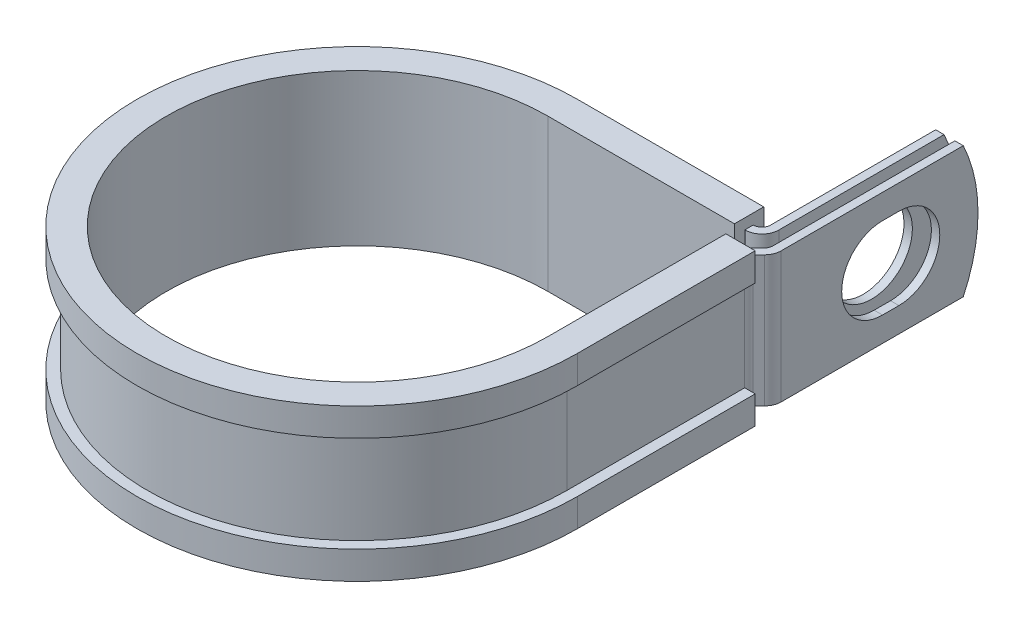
ISO-10303-21;
HEADER;
FILE_DESCRIPTION(('STEP AP214'),'2;1');
FILE_NAME('part.step','',(''),(''),'','','');
FILE_SCHEMA(('AUTOMOTIVE_DESIGN { 1 0 10303 214 1 1 1 1 }'));
ENDSEC;
DATA;
#1=APPLICATION_CONTEXT('core data for automotive mechanical design processes');
#2=APPLICATION_PROTOCOL_DEFINITION('international standard','automotive_design',2000,#1);
#3=PRODUCT_CONTEXT('',#1,'mechanical');
#4=PRODUCT('Part','Part','',(#3));
#5=PRODUCT_RELATED_PRODUCT_CATEGORY('part','',(#4));
#6=PRODUCT_DEFINITION_FORMATION('','',#4);
#7=PRODUCT_DEFINITION_CONTEXT('part definition',#1,'design');
#8=PRODUCT_DEFINITION('design','',#6,#7);
#9=PRODUCT_DEFINITION_SHAPE('','',#8);
#10=(LENGTH_UNIT() NAMED_UNIT(*) SI_UNIT(.MILLI.,.METRE.));
#11=(NAMED_UNIT(*) PLANE_ANGLE_UNIT() SI_UNIT($,.RADIAN.));
#12=(NAMED_UNIT(*) SI_UNIT($,.STERADIAN.) SOLID_ANGLE_UNIT());
#13=UNCERTAINTY_MEASURE_WITH_UNIT(LENGTH_MEASURE(1.E-05),#10,'distance_accuracy_value','');
#14=(GEOMETRIC_REPRESENTATION_CONTEXT(3) GLOBAL_UNCERTAINTY_ASSIGNED_CONTEXT((#13)) GLOBAL_UNIT_ASSIGNED_CONTEXT((#10,
#11,#12)) REPRESENTATION_CONTEXT('',''));
#15=CARTESIAN_POINT('',(0.,0.,0.));
#16=DIRECTION('',(0.,0.,1.));
#17=DIRECTION('',(1.,0.,0.));
#18=AXIS2_PLACEMENT_3D('',#15,#16,#17);
#19=CARTESIAN_POINT('',(29.9771698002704,-9.525,-29.2989));
#20=DIRECTION('',(0.,1.,0.));
#21=DIRECTION('',(1.,0.,0.));
#22=AXIS2_PLACEMENT_3D('',#19,#20,#21);
#23=PLANE('',#22);
#24=DIRECTION('',(0.,0.,-1.));
#25=VECTOR('',#24,1.);
#26=CARTESIAN_POINT('',(27.1323698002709,-9.525,-29.2989));
#27=LINE('',#26,#25);
#28=CARTESIAN_POINT('',(27.1323698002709,-9.525,-29.2989));
#29=VERTEX_POINT('',#28);
#30=CARTESIAN_POINT('',(27.1323698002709,-9.525,-30.5181));
#31=VERTEX_POINT('',#30);
#32=EDGE_CURVE('E524',#29,#31,#27,.T.);
#33=ORIENTED_EDGE('',*,*,#32,.T.);
#34=DIRECTION('',(-1.,0.,0.));
#35=VECTOR('',#34,1.);
#36=CARTESIAN_POINT('',(0.,-9.525,-30.5181));
#37=LINE('',#36,#35);
#38=CARTESIAN_POINT('',(27.1831698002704,-9.525,-30.5181));
#39=VERTEX_POINT('',#38);
#40=EDGE_CURVE('E411',#39,#31,#37,.T.);
#41=ORIENTED_EDGE('',*,*,#40,.F.);
#42=CARTESIAN_POINT('',(27.1831698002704,-9.525,-31.7373));
#43=DIRECTION('',(0.,1.,0.));
#44=DIRECTION('',(1.,0.,0.));
#45=AXIS2_PLACEMENT_3D('',#42,#43,#44);
#46=CIRCLE('',#45,1.2192);
#47=CARTESIAN_POINT('',(28.4023698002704,-9.525,-31.7373));
#48=VERTEX_POINT('',#47);
#49=EDGE_CURVE('E409',#48,#39,#46,.F.);
#50=ORIENTED_EDGE('',*,*,#49,.F.);
#51=DIRECTION('',(0.,0.,1.));
#52=VECTOR('',#51,1.);
#53=CARTESIAN_POINT('',(28.4023698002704,-9.525,-57.9374));
#54=LINE('',#53,#52);
#55=CARTESIAN_POINT('',(28.4023698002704,-9.525,-55.7928631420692));
#56=VERTEX_POINT('',#55);
#57=EDGE_CURVE('E407',#56,#48,#54,.T.);
#58=ORIENTED_EDGE('',*,*,#57,.F.);
#59=DIRECTION('',(-1.,0.,0.));
#60=VECTOR('',#59,1.);
#61=CARTESIAN_POINT('',(32.4155698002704,-9.525,-55.7928631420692));
#62=LINE('',#61,#60);
#63=CARTESIAN_POINT('',(29.6215698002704,-9.525,-55.7928631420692));
#64=VERTEX_POINT('',#63);
#65=EDGE_CURVE('E12',#64,#56,#62,.T.);
#66=ORIENTED_EDGE('',*,*,#65,.F.);
#67=DIRECTION('',(0.,0.,1.));
#68=VECTOR('',#67,1.);
#69=CARTESIAN_POINT('',(29.6215698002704,-9.525,-57.9374));
#70=LINE('',#69,#68);
#71=CARTESIAN_POINT('',(29.6215698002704,-9.525,-31.7373));
#72=VERTEX_POINT('',#71);
#73=EDGE_CURVE('E405',#64,#72,#70,.T.);
#74=ORIENTED_EDGE('',*,*,#73,.T.);
#75=CARTESIAN_POINT('',(27.1831698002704,-9.525,-31.7373));
#76=DIRECTION('',(0.,-1.,0.));
#77=DIRECTION('',(0.,0.,1.));
#78=AXIS2_PLACEMENT_3D('',#75,#76,#77);
#79=CIRCLE('',#78,2.4384);
#80=CARTESIAN_POINT('',(27.1831698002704,-9.525,-29.2989));
#81=VERTEX_POINT('',#80);
#82=EDGE_CURVE('E402',#72,#81,#79,.T.);
#83=ORIENTED_EDGE('',*,*,#82,.T.);
#84=DIRECTION('',(-1.,0.,0.));
#85=VECTOR('',#84,1.);
#86=CARTESIAN_POINT('',(0.,-9.525,-29.2989));
#87=LINE('',#86,#85);
#88=EDGE_CURVE('E399',#81,#29,#87,.T.);
#89=ORIENTED_EDGE('',*,*,#88,.T.);
#90=EDGE_LOOP('',(#33,#41,#50,#58,#66,#74,#83,#89));
#91=FACE_BOUND('',#90,.T.);
#92=ADVANCED_FACE('F55',(#91),#23,.F.);
#93=CARTESIAN_POINT('',(29.9771698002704,9.525,-29.2989));
#94=DIRECTION('',(0.,1.,0.));
#95=DIRECTION('',(1.,0.,0.));
#96=AXIS2_PLACEMENT_3D('',#93,#94,#95);
#97=PLANE('',#96);
#98=DIRECTION('',(-1.,0.,0.));
#99=VECTOR('',#98,1.);
#100=CARTESIAN_POINT('',(0.,9.525,-30.5181));
#101=LINE('',#100,#99);
#102=CARTESIAN_POINT('',(27.1831698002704,9.525,-30.5181));
#103=VERTEX_POINT('',#102);
#104=CARTESIAN_POINT('',(27.1323698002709,9.525,-30.5181));
#105=VERTEX_POINT('',#104);
#106=EDGE_CURVE('E369',#103,#105,#101,.T.);
#107=ORIENTED_EDGE('',*,*,#106,.T.);
#108=DIRECTION('',(0.,0.,1.));
#109=VECTOR('',#108,1.);
#110=CARTESIAN_POINT('',(27.1323698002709,9.525,-30.5181));
#111=LINE('',#110,#109);
#112=CARTESIAN_POINT('',(27.1323698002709,9.525,-29.2989));
#113=VERTEX_POINT('',#112);
#114=EDGE_CURVE('E518',#105,#113,#111,.T.);
#115=ORIENTED_EDGE('',*,*,#114,.T.);
#116=DIRECTION('',(-1.,0.,0.));
#117=VECTOR('',#116,1.);
#118=CARTESIAN_POINT('',(0.,9.525,-29.2989));
#119=LINE('',#118,#117);
#120=CARTESIAN_POINT('',(27.1831698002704,9.525,-29.2989));
#121=VERTEX_POINT('',#120);
#122=EDGE_CURVE('E626',#121,#113,#119,.T.);
#123=ORIENTED_EDGE('',*,*,#122,.F.);
#124=CARTESIAN_POINT('',(27.1831698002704,9.525,-31.7373));
#125=DIRECTION('',(0.,-1.,0.));
#126=DIRECTION('',(0.,0.,1.));
#127=AXIS2_PLACEMENT_3D('',#124,#125,#126);
#128=CIRCLE('',#127,2.4384);
#129=CARTESIAN_POINT('',(29.6215698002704,9.525,-31.7373));
#130=VERTEX_POINT('',#129);
#131=EDGE_CURVE('E371',#130,#121,#128,.T.);
#132=ORIENTED_EDGE('',*,*,#131,.F.);
#133=DIRECTION('',(0.,0.,1.));
#134=VECTOR('',#133,1.);
#135=CARTESIAN_POINT('',(29.6215698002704,9.525,-57.9374));
#136=LINE('',#135,#134);
#137=CARTESIAN_POINT('',(29.6215698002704,9.525,-55.7928631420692));
#138=VERTEX_POINT('',#137);
#139=EDGE_CURVE('E362',#138,#130,#136,.T.);
#140=ORIENTED_EDGE('',*,*,#139,.F.);
#141=DIRECTION('',(-1.,0.,0.));
#142=VECTOR('',#141,1.);
#143=CARTESIAN_POINT('',(32.4155698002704,9.525,-55.7928631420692));
#144=LINE('',#143,#142);
#145=CARTESIAN_POINT('',(28.4023698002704,9.525,-55.7928631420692));
#146=VERTEX_POINT('',#145);
#147=EDGE_CURVE('E63',#138,#146,#144,.T.);
#148=ORIENTED_EDGE('',*,*,#147,.T.);
#149=DIRECTION('',(0.,0.,1.));
#150=VECTOR('',#149,1.);
#151=CARTESIAN_POINT('',(28.4023698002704,9.525,-57.9374));
#152=LINE('',#151,#150);
#153=CARTESIAN_POINT('',(28.4023698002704,9.525,-31.7373));
#154=VERTEX_POINT('',#153);
#155=EDGE_CURVE('E359',#146,#154,#152,.T.);
#156=ORIENTED_EDGE('',*,*,#155,.T.);
#157=CARTESIAN_POINT('',(27.1831698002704,9.525,-31.7373));
#158=DIRECTION('',(0.,1.,0.));
#159=DIRECTION('',(1.,0.,0.));
#160=AXIS2_PLACEMENT_3D('',#157,#158,#159);
#161=CIRCLE('',#160,1.2192);
#162=EDGE_CURVE('E367',#154,#103,#161,.F.);
#163=ORIENTED_EDGE('',*,*,#162,.T.);
#164=EDGE_LOOP('',(#107,#115,#123,#132,#140,#148,#156,#163));
#165=FACE_BOUND('',#164,.T.);
#166=ADVANCED_FACE('F358',(#165),#97,.T.);
#167=CARTESIAN_POINT('',(0.,9.525,-29.2989));
#168=DIRECTION('',(0.,0.,1.));
#169=DIRECTION('',(1.,0.,0.));
#170=AXIS2_PLACEMENT_3D('',#167,#168,#169);
#171=PLANE('',#170);
#172=ORIENTED_EDGE('',*,*,#122,.T.);
#173=DIRECTION('',(0.,-1.,0.));
#174=VECTOR('',#173,1.);
#175=CARTESIAN_POINT('',(27.1323698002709,9.525,-29.2989));
#176=LINE('',#175,#174);
#177=EDGE_CURVE('E521',#113,#29,#176,.T.);
#178=ORIENTED_EDGE('',*,*,#177,.T.);
#179=ORIENTED_EDGE('',*,*,#88,.F.);
#180=DIRECTION('',(0.,-1.,0.));
#181=VECTOR('',#180,1.);
#182=CARTESIAN_POINT('',(27.1831698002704,9.525,-29.2989));
#183=LINE('',#182,#181);
#184=EDGE_CURVE('E345',#121,#81,#183,.T.);
#185=ORIENTED_EDGE('',*,*,#184,.F.);
#186=EDGE_LOOP('',(#172,#178,#179,#185));
#187=FACE_BOUND('',#186,.T.);
#188=ADVANCED_FACE('F636',(#187),#171,.T.);
#189=CARTESIAN_POINT('',(32.4155698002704,9.525,-29.2989));
#190=DIRECTION('',(-1.,0.,0.));
#191=DIRECTION('',(0.,0.,1.));
#192=AXIS2_PLACEMENT_3D('',#189,#190,#191);
#193=PLANE('',#192);
#194=CARTESIAN_POINT('',(32.4155698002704,0.,-46.4311999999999));
#195=DIRECTION('',(1.,0.,0.));
#196=DIRECTION('',(0.,0.,-1.));
#197=AXIS2_PLACEMENT_3D('',#194,#195,#196);
#198=CIRCLE('',#197,5.9436);
#199=CARTESIAN_POINT('',(32.4155698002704,-5.9436,-46.4312000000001));
#200=VERTEX_POINT('',#199);
#201=CARTESIAN_POINT('',(32.4155698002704,5.9436,-46.4312000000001));
#202=VERTEX_POINT('',#201);
#203=EDGE_CURVE('E581',#200,#202,#198,.T.);
#204=ORIENTED_EDGE('',*,*,#203,.F.);
#205=DIRECTION('',(0.,0.,-1.));
#206=VECTOR('',#205,1.);
#207=CARTESIAN_POINT('',(32.4155698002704,-5.9436,-44.0435999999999));
#208=LINE('',#207,#206);
#209=CARTESIAN_POINT('',(32.4155698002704,-5.9436,-44.0435999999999));
#210=VERTEX_POINT('',#209);
#211=EDGE_CURVE('E584',#210,#200,#208,.T.);
#212=ORIENTED_EDGE('',*,*,#211,.F.);
#213=CARTESIAN_POINT('',(32.4155698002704,0.,-44.0435999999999));
#214=DIRECTION('',(1.,0.,0.));
#215=DIRECTION('',(0.,0.,-1.));
#216=AXIS2_PLACEMENT_3D('',#213,#214,#215);
#217=CIRCLE('',#216,5.9436);
#218=CARTESIAN_POINT('',(32.4155698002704,5.9436,-44.0435999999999));
#219=VERTEX_POINT('',#218);
#220=EDGE_CURVE('E577',#219,#210,#217,.T.);
#221=ORIENTED_EDGE('',*,*,#220,.F.);
#222=DIRECTION('',(0.,0.,1.));
#223=VECTOR('',#222,1.);
#224=CARTESIAN_POINT('',(32.4155698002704,5.9436,-44.0435999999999));
#225=LINE('',#224,#223);
#226=EDGE_CURVE('E578',#202,#219,#225,.T.);
#227=ORIENTED_EDGE('',*,*,#226,.F.);
#228=EDGE_LOOP('',(#204,#212,#221,#227));
#229=FACE_BOUND('',#228,.T.);
#230=DIRECTION('',(0.,0.,-1.));
#231=VECTOR('',#230,1.);
#232=CARTESIAN_POINT('',(32.4155698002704,-9.525,-29.2989));
#233=LINE('',#232,#231);
#234=CARTESIAN_POINT('',(32.4155698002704,-9.525,-29.2989));
#235=VERTEX_POINT('',#234);
#236=CARTESIAN_POINT('',(32.4155698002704,-9.525,-55.7928631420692));
#237=VERTEX_POINT('',#236);
#238=EDGE_CURVE('E383',#235,#237,#233,.T.);
#239=ORIENTED_EDGE('',*,*,#238,.T.);
#240=CARTESIAN_POINT('',(32.4155698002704,0.,-35.7124));
#241=DIRECTION('',(-1.,0.,0.));
#242=DIRECTION('',(0.,0.,1.));
#243=AXIS2_PLACEMENT_3D('',#240,#241,#242);
#244=CIRCLE('',#243,22.225);
#245=CARTESIAN_POINT('',(32.4155698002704,9.525,-55.7928631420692));
#246=VERTEX_POINT('',#245);
#247=EDGE_CURVE('E569',#246,#237,#244,.T.);
#248=ORIENTED_EDGE('',*,*,#247,.F.);
#249=DIRECTION('',(0.,0.,-1.));
#250=VECTOR('',#249,1.);
#251=CARTESIAN_POINT('',(32.4155698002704,9.525,-29.2989));
#252=LINE('',#251,#250);
#253=CARTESIAN_POINT('',(32.4155698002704,9.525,-29.2989));
#254=VERTEX_POINT('',#253);
#255=EDGE_CURVE('E420',#254,#246,#252,.T.);
#256=ORIENTED_EDGE('',*,*,#255,.F.);
#257=DIRECTION('',(0.,-1.,0.));
#258=VECTOR('',#257,1.);
#259=CARTESIAN_POINT('',(32.4155698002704,9.525,-29.2989));
#260=LINE('',#259,#258);
#261=EDGE_CURVE('E382',#254,#235,#260,.T.);
#262=ORIENTED_EDGE('',*,*,#261,.T.);
#263=EDGE_LOOP('',(#239,#248,#256,#262));
#264=FACE_BOUND('',#263,.T.);
#265=ADVANCED_FACE('F57',(#229,#264),#193,.F.);
#266=CARTESIAN_POINT('',(31.1963698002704,9.525,-29.2989));
#267=DIRECTION('',(-1.,0.,0.));
#268=DIRECTION('',(0.,0.,1.));
#269=AXIS2_PLACEMENT_3D('',#266,#267,#268);
#270=PLANE('',#269);
#271=DIRECTION('',(0.,0.,-1.));
#272=VECTOR('',#271,1.);
#273=CARTESIAN_POINT('',(31.1963698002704,-5.9436,-44.0435999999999));
#274=LINE('',#273,#272);
#275=CARTESIAN_POINT('',(31.1963698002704,-5.9436,-44.0435999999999));
#276=VERTEX_POINT('',#275);
#277=CARTESIAN_POINT('',(31.1963698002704,-5.9436,-46.4312000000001));
#278=VERTEX_POINT('',#277);
#279=EDGE_CURVE('E580',#276,#278,#274,.T.);
#280=ORIENTED_EDGE('',*,*,#279,.T.);
#281=CARTESIAN_POINT('',(31.1963698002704,0.,-46.4311999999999));
#282=DIRECTION('',(-1.,0.,0.));
#283=DIRECTION('',(0.,0.,1.));
#284=AXIS2_PLACEMENT_3D('',#281,#282,#283);
#285=CIRCLE('',#284,5.9436);
#286=CARTESIAN_POINT('',(31.1963698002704,5.9436,-46.4312000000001));
#287=VERTEX_POINT('',#286);
#288=EDGE_CURVE('E601',#278,#287,#285,.F.);
#289=ORIENTED_EDGE('',*,*,#288,.T.);
#290=DIRECTION('',(0.,0.,1.));
#291=VECTOR('',#290,1.);
#292=CARTESIAN_POINT('',(31.1963698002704,5.9436,-44.0435999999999));
#293=LINE('',#292,#291);
#294=CARTESIAN_POINT('',(31.1963698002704,5.9436,-44.0435999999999));
#295=VERTEX_POINT('',#294);
#296=EDGE_CURVE('E597',#287,#295,#293,.T.);
#297=ORIENTED_EDGE('',*,*,#296,.T.);
#298=CARTESIAN_POINT('',(31.1963698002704,0.,-44.0435999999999));
#299=DIRECTION('',(-1.,0.,0.));
#300=DIRECTION('',(0.,0.,1.));
#301=AXIS2_PLACEMENT_3D('',#298,#299,#300);
#302=CIRCLE('',#301,5.9436);
#303=EDGE_CURVE('E592',#295,#276,#302,.F.);
#304=ORIENTED_EDGE('',*,*,#303,.T.);
#305=EDGE_LOOP('',(#280,#289,#297,#304));
#306=FACE_BOUND('',#305,.T.);
#307=CARTESIAN_POINT('',(31.1963698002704,0.,-35.7124));
#308=DIRECTION('',(-1.,0.,0.));
#309=DIRECTION('',(0.,0.,1.));
#310=AXIS2_PLACEMENT_3D('',#307,#308,#309);
#311=CIRCLE('',#310,22.225);
#312=CARTESIAN_POINT('',(31.1963698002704,9.525,-55.7928631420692));
#313=VERTEX_POINT('',#312);
#314=CARTESIAN_POINT('',(31.1963698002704,-9.525,-55.7928631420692));
#315=VERTEX_POINT('',#314);
#316=EDGE_CURVE('E77',#313,#315,#311,.T.);
#317=ORIENTED_EDGE('',*,*,#316,.T.);
#318=DIRECTION('',(0.,0.,-1.));
#319=VECTOR('',#318,1.);
#320=CARTESIAN_POINT('',(31.1963698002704,-9.525,-29.2989));
#321=LINE('',#320,#319);
#322=CARTESIAN_POINT('',(31.1963698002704,-9.525,-29.2989));
#323=VERTEX_POINT('',#322);
#324=EDGE_CURVE('E386',#323,#315,#321,.T.);
#325=ORIENTED_EDGE('',*,*,#324,.F.);
#326=DIRECTION('',(0.,-1.,0.));
#327=VECTOR('',#326,1.);
#328=CARTESIAN_POINT('',(31.1963698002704,9.525,-29.2989));
#329=LINE('',#328,#327);
#330=CARTESIAN_POINT('',(31.1963698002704,9.525,-29.2989));
#331=VERTEX_POINT('',#330);
#332=EDGE_CURVE('E353',#331,#323,#329,.T.);
#333=ORIENTED_EDGE('',*,*,#332,.F.);
#334=DIRECTION('',(0.,0.,-1.));
#335=VECTOR('',#334,1.);
#336=CARTESIAN_POINT('',(31.1963698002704,9.525,-29.2989));
#337=LINE('',#336,#335);
#338=EDGE_CURVE('E616',#331,#313,#337,.T.);
#339=ORIENTED_EDGE('',*,*,#338,.T.);
#340=EDGE_LOOP('',(#317,#325,#333,#339));
#341=FACE_BOUND('',#340,.T.);
#342=ADVANCED_FACE('F690',(#306,#341),#270,.T.);
#343=CARTESIAN_POINT('',(29.6215698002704,9.525,-57.9374));
#344=DIRECTION('',(1.,0.,0.));
#345=DIRECTION('',(0.,0.,-1.));
#346=AXIS2_PLACEMENT_3D('',#343,#344,#345);
#347=PLANE('',#346);
#348=CARTESIAN_POINT('',(29.6215698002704,0.,-45.2374));
#349=DIRECTION('',(1.,0.,0.));
#350=DIRECTION('',(0.,0.,-1.));
#351=AXIS2_PLACEMENT_3D('',#348,#349,#350);
#352=CIRCLE('',#351,5.9436);
#353=CARTESIAN_POINT('',(29.6215698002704,0.,-51.181));
#354=VERTEX_POINT('',#353);
#355=EDGE_CURVE('E387',#354,#354,#352,.F.);
#356=ORIENTED_EDGE('',*,*,#355,.T.);
#357=EDGE_LOOP('',(#356));
#358=FACE_BOUND('',#357,.T.);
#359=ORIENTED_EDGE('',*,*,#73,.F.);
#360=CARTESIAN_POINT('',(29.6215698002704,0.,-35.7124));
#361=DIRECTION('',(1.,0.,0.));
#362=DIRECTION('',(0.,0.,-1.));
#363=AXIS2_PLACEMENT_3D('',#360,#361,#362);
#364=CIRCLE('',#363,22.225);
#365=EDGE_CURVE('E574',#64,#138,#364,.T.);
#366=ORIENTED_EDGE('',*,*,#365,.T.);
#367=ORIENTED_EDGE('',*,*,#139,.T.);
#368=DIRECTION('',(0.,-1.,0.));
#369=VECTOR('',#368,1.);
#370=CARTESIAN_POINT('',(29.6215698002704,9.525,-31.7373));
#371=LINE('',#370,#369);
#372=EDGE_CURVE('E342',#130,#72,#371,.T.);
#373=ORIENTED_EDGE('',*,*,#372,.T.);
#374=EDGE_LOOP('',(#359,#366,#367,#373));
#375=FACE_BOUND('',#374,.T.);
#376=ADVANCED_FACE('F642',(#358,#375),#347,.T.);
#377=CARTESIAN_POINT('',(28.4023698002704,9.525,-57.9374));
#378=DIRECTION('',(1.,0.,0.));
#379=DIRECTION('',(0.,0.,-1.));
#380=AXIS2_PLACEMENT_3D('',#377,#378,#379);
#381=PLANE('',#380);
#382=CARTESIAN_POINT('',(28.4023698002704,0.,-45.2374));
#383=DIRECTION('',(-1.,0.,0.));
#384=DIRECTION('',(0.,0.,1.));
#385=AXIS2_PLACEMENT_3D('',#382,#383,#384);
#386=CIRCLE('',#385,5.9436);
#387=CARTESIAN_POINT('',(28.4023698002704,0.,-39.2938));
#388=VERTEX_POINT('',#387);
#389=EDGE_CURVE('E609',#388,#388,#386,.T.);
#390=ORIENTED_EDGE('',*,*,#389,.F.);
#391=EDGE_LOOP('',(#390));
#392=FACE_BOUND('',#391,.T.);
#393=CARTESIAN_POINT('',(28.4023698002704,0.,-35.7124));
#394=DIRECTION('',(-1.,0.,0.));
#395=DIRECTION('',(0.,0.,1.));
#396=AXIS2_PLACEMENT_3D('',#393,#394,#395);
#397=CIRCLE('',#396,22.225);
#398=EDGE_CURVE('E69',#146,#56,#397,.T.);
#399=ORIENTED_EDGE('',*,*,#398,.T.);
#400=ORIENTED_EDGE('',*,*,#57,.T.);
#401=DIRECTION('',(0.,-1.,0.));
#402=VECTOR('',#401,1.);
#403=CARTESIAN_POINT('',(28.4023698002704,9.525,-31.7373));
#404=LINE('',#403,#402);
#405=EDGE_CURVE('E339',#154,#48,#404,.T.);
#406=ORIENTED_EDGE('',*,*,#405,.F.);
#407=ORIENTED_EDGE('',*,*,#155,.F.);
#408=EDGE_LOOP('',(#399,#400,#406,#407));
#409=FACE_BOUND('',#408,.T.);
#410=ADVANCED_FACE('F365',(#392,#409),#381,.F.);
#411=CARTESIAN_POINT('',(31.7373,-9.525,-25.8864026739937));
#412=DIRECTION('',(0.,1.,0.));
#413=DIRECTION('',(1.,0.,0.));
#414=AXIS2_PLACEMENT_3D('',#411,#412,#413);
#415=CIRCLE('',#414,1.2192);
#416=CARTESIAN_POINT('',(30.5181,-9.525,-25.8864026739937));
#417=VERTEX_POINT('',#416);
#418=CARTESIAN_POINT('',(30.8751954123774,-9.525,-26.7485072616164));
#419=VERTEX_POINT('',#418);
#420=EDGE_CURVE('E414',#417,#419,#415,.F.);
#421=ORIENTED_EDGE('',*,*,#420,.F.);
#422=DIRECTION('',(1.,0.,0.));
#423=VECTOR('',#422,1.);
#424=CARTESIAN_POINT('',(29.2989,-9.525,-25.8864026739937));
#425=LINE('',#424,#423);
#426=CARTESIAN_POINT('',(29.2989,-9.525,-25.8864026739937));
#427=VERTEX_POINT('',#426);
#428=EDGE_CURVE('E452',#427,#417,#425,.T.);
#429=ORIENTED_EDGE('',*,*,#428,.F.);
#430=CARTESIAN_POINT('',(31.7373,-9.525,-25.8864026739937));
#431=DIRECTION('',(0.,-1.,0.));
#432=DIRECTION('',(0.,0.,1.));
#433=AXIS2_PLACEMENT_3D('',#430,#431,#432);
#434=CIRCLE('',#433,2.4384);
#435=CARTESIAN_POINT('',(30.0130908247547,-9.525,-27.610611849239));
#436=VERTEX_POINT('',#435);
#437=EDGE_CURVE('E396',#427,#436,#434,.T.);
#438=ORIENTED_EDGE('',*,*,#437,.T.);
#439=DIRECTION('',(0.707106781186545,0.,-0.70710678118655));
#440=VECTOR('',#439,1.);
#441=CARTESIAN_POINT('',(30.0130908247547,-9.525,-27.610611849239));
#442=LINE('',#441,#440);
#443=CARTESIAN_POINT('',(30.8392743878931,-9.525,-28.4367954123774));
#444=VERTEX_POINT('',#443);
#445=EDGE_CURVE('E393',#436,#444,#442,.T.);
#446=ORIENTED_EDGE('',*,*,#445,.T.);
#447=CARTESIAN_POINT('',(29.9771698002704,-9.525,-29.2989));
#448=DIRECTION('',(0.,1.,0.));
#449=DIRECTION('',(0.,0.,1.));
#450=AXIS2_PLACEMENT_3D('',#447,#448,#449);
#451=CIRCLE('',#450,1.2192);
#452=EDGE_CURVE('E390',#444,#323,#451,.T.);
#453=ORIENTED_EDGE('',*,*,#452,.T.);
#454=ORIENTED_EDGE('',*,*,#324,.T.);
#455=DIRECTION('',(-1.,0.,0.));
#456=VECTOR('',#455,1.);
#457=CARTESIAN_POINT('',(32.4155698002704,-9.525,-55.7928631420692));
#458=LINE('',#457,#456);
#459=EDGE_CURVE('E567',#237,#315,#458,.T.);
#460=ORIENTED_EDGE('',*,*,#459,.F.);
#461=ORIENTED_EDGE('',*,*,#238,.F.);
#462=CARTESIAN_POINT('',(29.9771698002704,-9.525,-29.2989));
#463=DIRECTION('',(0.,1.,0.));
#464=DIRECTION('',(1.,0.,0.));
#465=AXIS2_PLACEMENT_3D('',#462,#463,#464);
#466=CIRCLE('',#465,2.4384);
#467=CARTESIAN_POINT('',(31.7013789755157,-9.525,-27.5746908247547));
#468=VERTEX_POINT('',#467);
#469=EDGE_CURVE('E418',#468,#235,#466,.T.);
#470=ORIENTED_EDGE('',*,*,#469,.F.);
#471=DIRECTION('',(0.707106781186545,0.,-0.70710678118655));
#472=VECTOR('',#471,1.);
#473=CARTESIAN_POINT('',(30.8751954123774,-9.525,-26.7485072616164));
#474=LINE('',#473,#472);
#475=EDGE_CURVE('E416',#419,#468,#474,.T.);
#476=ORIENTED_EDGE('',*,*,#475,.F.);
#477=EDGE_LOOP('',(#421,#429,#438,#446,#453,#454,#460,#461,#470,#476));
#478=FACE_BOUND('',#477,.T.);
#479=ADVANCED_FACE('F676',(#478),#23,.F.);
#480=DIRECTION('',(-1.,0.,0.));
#481=VECTOR('',#480,1.);
#482=CARTESIAN_POINT('',(30.5181,9.525,-25.8864026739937));
#483=LINE('',#482,#481);
#484=CARTESIAN_POINT('',(30.5181,9.525,-25.8864026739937));
#485=VERTEX_POINT('',#484);
#486=CARTESIAN_POINT('',(29.2989,9.525,-25.8864026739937));
#487=VERTEX_POINT('',#486);
#488=EDGE_CURVE('E441',#485,#487,#483,.T.);
#489=ORIENTED_EDGE('',*,*,#488,.F.);
#490=CARTESIAN_POINT('',(31.7373,9.525,-25.8864026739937));
#491=DIRECTION('',(0.,1.,0.));
#492=DIRECTION('',(1.,0.,0.));
#493=AXIS2_PLACEMENT_3D('',#490,#491,#492);
#494=CIRCLE('',#493,1.2192);
#495=CARTESIAN_POINT('',(30.8751954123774,9.525,-26.7485072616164));
#496=VERTEX_POINT('',#495);
#497=EDGE_CURVE('E376',#485,#496,#494,.F.);
#498=ORIENTED_EDGE('',*,*,#497,.T.);
#499=DIRECTION('',(0.707106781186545,0.,-0.70710678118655));
#500=VECTOR('',#499,1.);
#501=CARTESIAN_POINT('',(30.8751954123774,9.525,-26.7485072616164));
#502=LINE('',#501,#500);
#503=CARTESIAN_POINT('',(31.7013789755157,9.525,-27.5746908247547));
#504=VERTEX_POINT('',#503);
#505=EDGE_CURVE('E378',#496,#504,#502,.T.);
#506=ORIENTED_EDGE('',*,*,#505,.T.);
#507=CARTESIAN_POINT('',(29.9771698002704,9.525,-29.2989));
#508=DIRECTION('',(0.,1.,0.));
#509=DIRECTION('',(1.,0.,0.));
#510=AXIS2_PLACEMENT_3D('',#507,#508,#509);
#511=CIRCLE('',#510,2.4384);
#512=EDGE_CURVE('E380',#504,#254,#511,.T.);
#513=ORIENTED_EDGE('',*,*,#512,.T.);
#514=ORIENTED_EDGE('',*,*,#255,.T.);
#515=DIRECTION('',(-1.,0.,0.));
#516=VECTOR('',#515,1.);
#517=CARTESIAN_POINT('',(32.4155698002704,9.525,-55.7928631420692));
#518=LINE('',#517,#516);
#519=EDGE_CURVE('E571',#246,#313,#518,.T.);
#520=ORIENTED_EDGE('',*,*,#519,.T.);
#521=ORIENTED_EDGE('',*,*,#338,.F.);
#522=CARTESIAN_POINT('',(29.9771698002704,9.525,-29.2989));
#523=DIRECTION('',(0.,1.,0.));
#524=DIRECTION('',(0.,0.,1.));
#525=AXIS2_PLACEMENT_3D('',#522,#523,#524);
#526=CIRCLE('',#525,1.2192);
#527=CARTESIAN_POINT('',(30.8392743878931,9.525,-28.4367954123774));
#528=VERTEX_POINT('',#527);
#529=EDGE_CURVE('E619',#528,#331,#526,.T.);
#530=ORIENTED_EDGE('',*,*,#529,.F.);
#531=DIRECTION('',(0.707106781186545,0.,-0.70710678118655));
#532=VECTOR('',#531,1.);
#533=CARTESIAN_POINT('',(30.0130908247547,9.525,-27.610611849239));
#534=LINE('',#533,#532);
#535=CARTESIAN_POINT('',(30.0130908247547,9.525,-27.610611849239));
#536=VERTEX_POINT('',#535);
#537=EDGE_CURVE('E622',#536,#528,#534,.T.);
#538=ORIENTED_EDGE('',*,*,#537,.F.);
#539=CARTESIAN_POINT('',(31.7373,9.525,-25.8864026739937));
#540=DIRECTION('',(0.,-1.,0.));
#541=DIRECTION('',(0.,0.,1.));
#542=AXIS2_PLACEMENT_3D('',#539,#540,#541);
#543=CIRCLE('',#542,2.4384);
#544=EDGE_CURVE('E451',#487,#536,#543,.T.);
#545=ORIENTED_EDGE('',*,*,#544,.F.);
#546=EDGE_LOOP('',(#489,#498,#506,#513,#514,#520,#521,#530,#538,#545));
#547=FACE_BOUND('',#546,.T.);
#548=ADVANCED_FACE('F448',(#547),#97,.T.);
#549=CARTESIAN_POINT('',(29.9771698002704,9.525,-29.2989));
#550=DIRECTION('',(0.,-1.,0.));
#551=DIRECTION('',(0.,0.,-1.));
#552=AXIS2_PLACEMENT_3D('',#549,#550,#551);
#553=CYLINDRICAL_SURFACE('',#552,1.2192);
#554=ORIENTED_EDGE('',*,*,#452,.F.);
#555=DIRECTION('',(0.,-1.,0.));
#556=VECTOR('',#555,1.);
#557=CARTESIAN_POINT('',(30.8392743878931,9.525,-28.4367954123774));
#558=LINE('',#557,#556);
#559=EDGE_CURVE('E351',#528,#444,#558,.T.);
#560=ORIENTED_EDGE('',*,*,#559,.F.);
#561=ORIENTED_EDGE('',*,*,#529,.T.);
#562=ORIENTED_EDGE('',*,*,#332,.T.);
#563=EDGE_LOOP('',(#554,#560,#561,#562));
#564=FACE_BOUND('',#563,.T.);
#565=ADVANCED_FACE('F686',(#564),#553,.F.);
#566=CARTESIAN_POINT('',(30.0130908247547,9.525,-27.610611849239));
#567=DIRECTION('',(-0.70710678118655,0.,-0.707106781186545));
#568=DIRECTION('',(-0.707106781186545,0.,0.70710678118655));
#569=AXIS2_PLACEMENT_3D('',#566,#567,#568);
#570=PLANE('',#569);
#571=ORIENTED_EDGE('',*,*,#445,.F.);
#572=DIRECTION('',(0.,-1.,0.));
#573=VECTOR('',#572,1.);
#574=CARTESIAN_POINT('',(30.0130908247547,9.525,-27.610611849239));
#575=LINE('',#574,#573);
#576=EDGE_CURVE('E349',#536,#436,#575,.T.);
#577=ORIENTED_EDGE('',*,*,#576,.F.);
#578=ORIENTED_EDGE('',*,*,#537,.T.);
#579=ORIENTED_EDGE('',*,*,#559,.T.);
#580=EDGE_LOOP('',(#571,#577,#578,#579));
#581=FACE_BOUND('',#580,.T.);
#582=ADVANCED_FACE('F681',(#581),#570,.T.);
#583=CARTESIAN_POINT('',(31.7373,9.525,-25.8864026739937));
#584=DIRECTION('',(0.,-1.,0.));
#585=DIRECTION('',(0.,0.,-1.));
#586=AXIS2_PLACEMENT_3D('',#583,#584,#585);
#587=CYLINDRICAL_SURFACE('',#586,2.4384);
#588=ORIENTED_EDGE('',*,*,#437,.F.);
#589=DIRECTION('',(0.,-1.,0.));
#590=VECTOR('',#589,1.);
#591=CARTESIAN_POINT('',(29.2989,9.525,-25.8864026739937));
#592=LINE('',#591,#590);
#593=EDGE_CURVE('E347',#487,#427,#592,.T.);
#594=ORIENTED_EDGE('',*,*,#593,.F.);
#595=ORIENTED_EDGE('',*,*,#544,.T.);
#596=ORIENTED_EDGE('',*,*,#576,.T.);
#597=EDGE_LOOP('',(#588,#594,#595,#596));
#598=FACE_BOUND('',#597,.T.);
#599=ADVANCED_FACE('F678',(#598),#587,.T.);
#600=CARTESIAN_POINT('',(27.1831698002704,9.525,-31.7373));
#601=DIRECTION('',(0.,-1.,0.));
#602=DIRECTION('',(0.,0.,-1.));
#603=AXIS2_PLACEMENT_3D('',#600,#601,#602);
#604=CYLINDRICAL_SURFACE('',#603,2.4384);
#605=ORIENTED_EDGE('',*,*,#82,.F.);
#606=ORIENTED_EDGE('',*,*,#372,.F.);
#607=ORIENTED_EDGE('',*,*,#131,.T.);
#608=ORIENTED_EDGE('',*,*,#184,.T.);
#609=EDGE_LOOP('',(#605,#606,#607,#608));
#610=FACE_BOUND('',#609,.T.);
#611=ADVANCED_FACE('F632',(#610),#604,.T.);
#612=CARTESIAN_POINT('',(27.1831698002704,9.525,-31.7373));
#613=DIRECTION('',(0.,-1.,0.));
#614=DIRECTION('',(0.,0.,-1.));
#615=AXIS2_PLACEMENT_3D('',#612,#613,#614);
#616=CYLINDRICAL_SURFACE('',#615,1.2192);
#617=ORIENTED_EDGE('',*,*,#49,.T.);
#618=DIRECTION('',(0.,-1.,0.));
#619=VECTOR('',#618,1.);
#620=CARTESIAN_POINT('',(27.1831698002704,9.525,-30.5181));
#621=LINE('',#620,#619);
#622=EDGE_CURVE('E330',#103,#39,#621,.T.);
#623=ORIENTED_EDGE('',*,*,#622,.F.);
#624=ORIENTED_EDGE('',*,*,#162,.F.);
#625=ORIENTED_EDGE('',*,*,#405,.T.);
#626=EDGE_LOOP('',(#617,#623,#624,#625));
#627=FACE_BOUND('',#626,.T.);
#628=ADVANCED_FACE('F647',(#627),#616,.F.);
#629=CARTESIAN_POINT('',(0.,9.525,-30.5181));
#630=DIRECTION('',(0.,0.,1.));
#631=DIRECTION('',(1.,0.,0.));
#632=AXIS2_PLACEMENT_3D('',#629,#630,#631);
#633=PLANE('',#632);
#634=DIRECTION('',(0.,-1.,0.));
#635=VECTOR('',#634,1.);
#636=CARTESIAN_POINT('',(0.,9.525,-30.5181));
#637=LINE('',#636,#635);
#638=CARTESIAN_POINT('',(4.28082201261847E-13,6.985,-30.5181));
#639=VERTEX_POINT('',#638);
#640=CARTESIAN_POINT('',(4.28082201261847E-13,-6.985,-30.5181));
#641=VERTEX_POINT('',#640);
#642=EDGE_CURVE('E321',#639,#641,#637,.T.);
#643=ORIENTED_EDGE('',*,*,#642,.F.);
#644=DIRECTION('',(1.,0.,0.));
#645=VECTOR('',#644,1.);
#646=CARTESIAN_POINT('',(4.28082201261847E-13,6.985,-30.5181));
#647=LINE('',#646,#645);
#648=CARTESIAN_POINT('',(27.1323698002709,6.985,-30.5181));
#649=VERTEX_POINT('',#648);
#650=EDGE_CURVE('E564',#639,#649,#647,.T.);
#651=ORIENTED_EDGE('',*,*,#650,.T.);
#652=DIRECTION('',(0.,1.,0.));
#653=VECTOR('',#652,1.);
#654=CARTESIAN_POINT('',(27.1323698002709,9.525,-30.5181));
#655=LINE('',#654,#653);
#656=EDGE_CURVE('E515',#649,#105,#655,.T.);
#657=ORIENTED_EDGE('',*,*,#656,.T.);
#658=ORIENTED_EDGE('',*,*,#106,.F.);
#659=ORIENTED_EDGE('',*,*,#622,.T.);
#660=ORIENTED_EDGE('',*,*,#40,.T.);
#661=DIRECTION('',(0.,1.,0.));
#662=VECTOR('',#661,1.);
#663=CARTESIAN_POINT('',(27.1323698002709,-9.525,-30.5181));
#664=LINE('',#663,#662);
#665=CARTESIAN_POINT('',(27.1323698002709,-6.985,-30.5181));
#666=VERTEX_POINT('',#665);
#667=EDGE_CURVE('E527',#31,#666,#664,.T.);
#668=ORIENTED_EDGE('',*,*,#667,.T.);
#669=DIRECTION('',(1.,0.,0.));
#670=VECTOR('',#669,1.);
#671=CARTESIAN_POINT('',(4.28082201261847E-13,-6.985,-30.5181));
#672=LINE('',#671,#670);
#673=EDGE_CURVE('E544',#641,#666,#672,.T.);
#674=ORIENTED_EDGE('',*,*,#673,.F.);
#675=EDGE_LOOP('',(#643,#651,#657,#658,#659,#660,#668,#674));
#676=FACE_BOUND('',#675,.T.);
#677=ADVANCED_FACE('F651',(#676),#633,.F.);
#678=CARTESIAN_POINT('',(0.,9.525,0.));
#679=DIRECTION('',(0.,-1.,0.));
#680=DIRECTION('',(0.,0.,-1.));
#681=AXIS2_PLACEMENT_3D('',#678,#679,#680);
#682=CYLINDRICAL_SURFACE('',#681,30.5181);
#683=DIRECTION('',(0.,-1.,0.));
#684=VECTOR('',#683,1.);
#685=CARTESIAN_POINT('',(30.5181,9.525,0.));
#686=LINE('',#685,#684);
#687=CARTESIAN_POINT('',(30.5181,6.985,0.));
#688=VERTEX_POINT('',#687);
#689=CARTESIAN_POINT('',(30.5181,-6.985,0.));
#690=VERTEX_POINT('',#689);
#691=EDGE_CURVE('E319',#688,#690,#686,.T.);
#692=ORIENTED_EDGE('',*,*,#691,.F.);
#693=CARTESIAN_POINT('',(0.,6.985,0.));
#694=DIRECTION('',(0.,-1.,0.));
#695=DIRECTION('',(0.,0.,-1.));
#696=AXIS2_PLACEMENT_3D('',#693,#694,#695);
#697=CIRCLE('',#696,30.5181);
#698=EDGE_CURVE('E513',#688,#639,#697,.T.);
#699=ORIENTED_EDGE('',*,*,#698,.T.);
#700=ORIENTED_EDGE('',*,*,#642,.T.);
#701=CARTESIAN_POINT('',(0.,-6.985,0.));
#702=DIRECTION('',(0.,-1.,0.));
#703=DIRECTION('',(0.,0.,-1.));
#704=AXIS2_PLACEMENT_3D('',#701,#702,#703);
#705=CIRCLE('',#704,30.5181);
#706=EDGE_CURVE('E302',#690,#641,#705,.T.);
#707=ORIENTED_EDGE('',*,*,#706,.F.);
#708=EDGE_LOOP('',(#692,#699,#700,#707));
#709=FACE_BOUND('',#708,.T.);
#710=ADVANCED_FACE('F317',(#709),#682,.T.);
#711=CARTESIAN_POINT('',(30.5181,9.525,0.));
#712=DIRECTION('',(-1.,0.,0.));
#713=DIRECTION('',(0.,0.,1.));
#714=AXIS2_PLACEMENT_3D('',#711,#712,#713);
#715=PLANE('',#714);
#716=DIRECTION('',(0.,-1.,0.));
#717=VECTOR('',#716,1.);
#718=CARTESIAN_POINT('',(30.5181,9.525,-25.8864026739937));
#719=LINE('',#718,#717);
#720=CARTESIAN_POINT('',(30.5181,6.985,-25.8864026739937));
#721=VERTEX_POINT('',#720);
#722=CARTESIAN_POINT('',(30.5181,-6.985,-25.8864026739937));
#723=VERTEX_POINT('',#722);
#724=EDGE_CURVE('E333',#721,#723,#719,.T.);
#725=ORIENTED_EDGE('',*,*,#724,.F.);
#726=DIRECTION('',(0.,0.,-1.));
#727=VECTOR('',#726,1.);
#728=CARTESIAN_POINT('',(30.5181,6.985,0.));
#729=LINE('',#728,#727);
#730=EDGE_CURVE('E327',#688,#721,#729,.T.);
#731=ORIENTED_EDGE('',*,*,#730,.F.);
#732=ORIENTED_EDGE('',*,*,#691,.T.);
#733=DIRECTION('',(0.,0.,-1.));
#734=VECTOR('',#733,1.);
#735=CARTESIAN_POINT('',(30.5181,-6.985,0.));
#736=LINE('',#735,#734);
#737=EDGE_CURVE('E298',#690,#723,#736,.T.);
#738=ORIENTED_EDGE('',*,*,#737,.T.);
#739=EDGE_LOOP('',(#725,#731,#732,#738));
#740=FACE_BOUND('',#739,.T.);
#741=ADVANCED_FACE('F326',(#740),#715,.F.);
#742=CARTESIAN_POINT('',(31.7373,9.525,-25.8864026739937));
#743=DIRECTION('',(0.,-1.,0.));
#744=DIRECTION('',(0.,0.,-1.));
#745=AXIS2_PLACEMENT_3D('',#742,#743,#744);
#746=CYLINDRICAL_SURFACE('',#745,1.2192);
#747=ORIENTED_EDGE('',*,*,#420,.T.);
#748=DIRECTION('',(0.,-1.,0.));
#749=VECTOR('',#748,1.);
#750=CARTESIAN_POINT('',(30.8751954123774,9.525,-26.7485072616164));
#751=LINE('',#750,#749);
#752=EDGE_CURVE('E425',#496,#419,#751,.T.);
#753=ORIENTED_EDGE('',*,*,#752,.F.);
#754=ORIENTED_EDGE('',*,*,#497,.F.);
#755=EDGE_CURVE('E328',#485,#721,#719,.T.);
#756=ORIENTED_EDGE('',*,*,#755,.T.);
#757=ORIENTED_EDGE('',*,*,#724,.T.);
#758=DIRECTION('',(0.,1.,0.));
#759=VECTOR('',#758,1.);
#760=CARTESIAN_POINT('',(30.5181,-9.525,-25.8864026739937));
#761=LINE('',#760,#759);
#762=EDGE_CURVE('E434',#417,#723,#761,.T.);
#763=ORIENTED_EDGE('',*,*,#762,.F.);
#764=EDGE_LOOP('',(#747,#753,#754,#756,#757,#763));
#765=FACE_BOUND('',#764,.T.);
#766=ADVANCED_FACE('F433',(#765),#746,.F.);
#767=CARTESIAN_POINT('',(30.8751954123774,9.525,-26.7485072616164));
#768=DIRECTION('',(-0.70710678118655,0.,-0.707106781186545));
#769=DIRECTION('',(-0.707106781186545,0.,0.70710678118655));
#770=AXIS2_PLACEMENT_3D('',#767,#768,#769);
#771=PLANE('',#770);
#772=ORIENTED_EDGE('',*,*,#475,.T.);
#773=DIRECTION('',(0.,-1.,0.));
#774=VECTOR('',#773,1.);
#775=CARTESIAN_POINT('',(31.7013789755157,9.525,-27.5746908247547));
#776=LINE('',#775,#774);
#777=EDGE_CURVE('E423',#504,#468,#776,.T.);
#778=ORIENTED_EDGE('',*,*,#777,.F.);
#779=ORIENTED_EDGE('',*,*,#505,.F.);
#780=ORIENTED_EDGE('',*,*,#752,.T.);
#781=EDGE_LOOP('',(#772,#778,#779,#780));
#782=FACE_BOUND('',#781,.T.);
#783=ADVANCED_FACE('F702',(#782),#771,.F.);
#784=CARTESIAN_POINT('',(29.9771698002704,9.525,-29.2989));
#785=DIRECTION('',(0.,-1.,0.));
#786=DIRECTION('',(0.,0.,-1.));
#787=AXIS2_PLACEMENT_3D('',#784,#785,#786);
#788=CYLINDRICAL_SURFACE('',#787,2.4384);
#789=ORIENTED_EDGE('',*,*,#469,.T.);
#790=ORIENTED_EDGE('',*,*,#261,.F.);
#791=ORIENTED_EDGE('',*,*,#512,.F.);
#792=ORIENTED_EDGE('',*,*,#777,.T.);
#793=EDGE_LOOP('',(#789,#790,#791,#792));
#794=FACE_BOUND('',#793,.T.);
#795=ADVANCED_FACE('F700',(#794),#788,.T.);
#796=CARTESIAN_POINT('',(46.4326092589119,0.,-45.2374));
#797=DIRECTION('',(-1.,0.,0.));
#798=DIRECTION('',(0.,0.,1.));
#799=AXIS2_PLACEMENT_3D('',#796,#797,#798);
#800=CYLINDRICAL_SURFACE('',#799,5.9436);
#801=ORIENTED_EDGE('',*,*,#389,.T.);
#802=EDGE_LOOP('',(#801));
#803=FACE_BOUND('',#802,.T.);
#804=ORIENTED_EDGE('',*,*,#355,.F.);
#805=EDGE_LOOP('',(#804));
#806=FACE_BOUND('',#805,.T.);
#807=ADVANCED_FACE('F709',(#803,#806),#800,.F.);
#808=CARTESIAN_POINT('',(12.6201635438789,-5.9436,-44.0435999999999));
#809=DIRECTION('',(0.,-1.,0.));
#810=DIRECTION('',(0.,0.,-1.));
#811=AXIS2_PLACEMENT_3D('',#808,#809,#810);
#812=PLANE('',#811);
#813=DIRECTION('',(1.,0.,0.));
#814=VECTOR('',#813,1.);
#815=CARTESIAN_POINT('',(12.6201635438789,-5.9436,-44.0435999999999));
#816=LINE('',#815,#814);
#817=EDGE_CURVE('E595',#276,#210,#816,.T.);
#818=ORIENTED_EDGE('',*,*,#817,.T.);
#819=ORIENTED_EDGE('',*,*,#211,.T.);
#820=DIRECTION('',(1.,0.,0.));
#821=VECTOR('',#820,1.);
#822=CARTESIAN_POINT('',(12.6201635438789,-5.9436,-46.4312000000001));
#823=LINE('',#822,#821);
#824=EDGE_CURVE('E591',#278,#200,#823,.T.);
#825=ORIENTED_EDGE('',*,*,#824,.F.);
#826=ORIENTED_EDGE('',*,*,#279,.F.);
#827=EDGE_LOOP('',(#818,#819,#825,#826));
#828=FACE_BOUND('',#827,.T.);
#829=ADVANCED_FACE('F752',(#828),#812,.F.);
#830=CARTESIAN_POINT('',(12.6201635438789,0.,-46.4311999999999));
#831=DIRECTION('',(1.,0.,0.));
#832=DIRECTION('',(0.,0.,-1.));
#833=AXIS2_PLACEMENT_3D('',#830,#831,#832);
#834=CYLINDRICAL_SURFACE('',#833,5.9436);
#835=ORIENTED_EDGE('',*,*,#824,.T.);
#836=ORIENTED_EDGE('',*,*,#203,.T.);
#837=DIRECTION('',(1.,0.,0.));
#838=VECTOR('',#837,1.);
#839=CARTESIAN_POINT('',(12.6201635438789,5.9436,-46.4312000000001));
#840=LINE('',#839,#838);
#841=EDGE_CURVE('E600',#287,#202,#840,.T.);
#842=ORIENTED_EDGE('',*,*,#841,.F.);
#843=ORIENTED_EDGE('',*,*,#288,.F.);
#844=EDGE_LOOP('',(#835,#836,#842,#843));
#845=FACE_BOUND('',#844,.T.);
#846=ADVANCED_FACE('F756',(#845),#834,.F.);
#847=CARTESIAN_POINT('',(12.6201635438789,5.9436,-44.0435999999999));
#848=DIRECTION('',(0.,1.,0.));
#849=DIRECTION('',(0.,0.,1.));
#850=AXIS2_PLACEMENT_3D('',#847,#848,#849);
#851=PLANE('',#850);
#852=ORIENTED_EDGE('',*,*,#841,.T.);
#853=ORIENTED_EDGE('',*,*,#226,.T.);
#854=DIRECTION('',(1.,0.,0.));
#855=VECTOR('',#854,1.);
#856=CARTESIAN_POINT('',(12.6201635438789,5.9436,-44.0435999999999));
#857=LINE('',#856,#855);
#858=EDGE_CURVE('E596',#295,#219,#857,.T.);
#859=ORIENTED_EDGE('',*,*,#858,.F.);
#860=ORIENTED_EDGE('',*,*,#296,.F.);
#861=EDGE_LOOP('',(#852,#853,#859,#860));
#862=FACE_BOUND('',#861,.T.);
#863=ADVANCED_FACE('F760',(#862),#851,.F.);
#864=CARTESIAN_POINT('',(12.6201635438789,0.,-44.0435999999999));
#865=DIRECTION('',(1.,0.,0.));
#866=DIRECTION('',(0.,0.,-1.));
#867=AXIS2_PLACEMENT_3D('',#864,#865,#866);
#868=CYLINDRICAL_SURFACE('',#867,5.9436);
#869=ORIENTED_EDGE('',*,*,#858,.T.);
#870=ORIENTED_EDGE('',*,*,#220,.T.);
#871=ORIENTED_EDGE('',*,*,#817,.F.);
#872=ORIENTED_EDGE('',*,*,#303,.F.);
#873=EDGE_LOOP('',(#869,#870,#871,#872));
#874=FACE_BOUND('',#873,.T.);
#875=ADVANCED_FACE('F764',(#874),#868,.F.);
#876=CARTESIAN_POINT('',(32.4155698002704,0.,-35.7124));
#877=DIRECTION('',(-1.,0.,0.));
#878=DIRECTION('',(0.,0.,1.));
#879=AXIS2_PLACEMENT_3D('',#876,#877,#878);
#880=CYLINDRICAL_SURFACE('',#879,22.225);
#881=ORIENTED_EDGE('',*,*,#365,.F.);
#882=ORIENTED_EDGE('',*,*,#65,.T.);
#883=ORIENTED_EDGE('',*,*,#398,.F.);
#884=ORIENTED_EDGE('',*,*,#147,.F.);
#885=EDGE_LOOP('',(#881,#882,#883,#884));
#886=FACE_BOUND('',#885,.T.);
#887=ADVANCED_FACE('F643',(#886),#880,.T.);
#888=ORIENTED_EDGE('',*,*,#519,.F.);
#889=ORIENTED_EDGE('',*,*,#247,.T.);
#890=ORIENTED_EDGE('',*,*,#459,.T.);
#891=ORIENTED_EDGE('',*,*,#316,.F.);
#892=EDGE_LOOP('',(#888,#889,#890,#891));
#893=FACE_BOUND('',#892,.T.);
#894=ADVANCED_FACE('F691',(#893),#880,.T.);
#895=CARTESIAN_POINT('',(4.4945958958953E-13,11.049,-32.0421));
#896=DIRECTION('',(0.,0.,1.));
#897=DIRECTION('',(1.,0.,0.));
#898=AXIS2_PLACEMENT_3D('',#895,#896,#897);
#899=PLANE('',#898);
#900=DIRECTION('',(0.,-1.,0.));
#901=VECTOR('',#900,1.);
#902=CARTESIAN_POINT('',(4.4945958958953E-13,11.049,-32.0421));
#903=LINE('',#902,#901);
#904=CARTESIAN_POINT('',(4.4945958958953E-13,11.049,-32.0421));
#905=VERTEX_POINT('',#904);
#906=CARTESIAN_POINT('',(4.4945958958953E-13,6.985,-32.0421));
#907=VERTEX_POINT('',#906);
#908=EDGE_CURVE('E323',#905,#907,#903,.T.);
#909=ORIENTED_EDGE('',*,*,#908,.F.);
#910=DIRECTION('',(1.,0.,0.));
#911=VECTOR('',#910,1.);
#912=CARTESIAN_POINT('',(4.4945958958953E-13,11.049,-32.0421));
#913=LINE('',#912,#911);
#914=CARTESIAN_POINT('',(27.1323698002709,11.049,-32.0421));
#915=VERTEX_POINT('',#914);
#916=EDGE_CURVE('E558',#905,#915,#913,.T.);
#917=ORIENTED_EDGE('',*,*,#916,.T.);
#918=DIRECTION('',(0.,-1.,0.));
#919=VECTOR('',#918,1.);
#920=CARTESIAN_POINT('',(27.1323698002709,11.049,-32.0421));
#921=LINE('',#920,#919);
#922=CARTESIAN_POINT('',(27.1323698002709,6.985,-32.0421));
#923=VERTEX_POINT('',#922);
#924=EDGE_CURVE('E540',#915,#923,#921,.T.);
#925=ORIENTED_EDGE('',*,*,#924,.T.);
#926=DIRECTION('',(1.,0.,0.));
#927=VECTOR('',#926,1.);
#928=CARTESIAN_POINT('',(4.4945958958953E-13,6.985,-32.0421));
#929=LINE('',#928,#927);
#930=EDGE_CURVE('E561',#907,#923,#929,.T.);
#931=ORIENTED_EDGE('',*,*,#930,.F.);
#932=EDGE_LOOP('',(#909,#917,#925,#931));
#933=FACE_BOUND('',#932,.T.);
#934=ADVANCED_FACE('F855',(#933),#899,.F.);
#935=CARTESIAN_POINT('',(3.89602902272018E-13,11.049,-27.7749));
#936=DIRECTION('',(0.,0.,-1.));
#937=DIRECTION('',(0.,1.,0.));
#938=AXIS2_PLACEMENT_3D('',#935,#936,#937);
#939=PLANE('',#938);
#940=DIRECTION('',(0.,1.,0.));
#941=VECTOR('',#940,1.);
#942=CARTESIAN_POINT('',(3.89602902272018E-13,11.049,-27.7749));
#943=LINE('',#942,#941);
#944=CARTESIAN_POINT('',(3.89602902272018E-13,-11.049,-27.7749));
#945=VERTEX_POINT('',#944);
#946=CARTESIAN_POINT('',(3.89602902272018E-13,11.049,-27.7749));
#947=VERTEX_POINT('',#946);
#948=EDGE_CURVE('E491',#945,#947,#943,.T.);
#949=ORIENTED_EDGE('',*,*,#948,.F.);
#950=DIRECTION('',(1.,0.,0.));
#951=VECTOR('',#950,1.);
#952=CARTESIAN_POINT('',(3.89602902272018E-13,-11.049,-27.7749));
#953=LINE('',#952,#951);
#954=CARTESIAN_POINT('',(27.1323698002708,-11.049,-27.7749));
#955=VERTEX_POINT('',#954);
#956=EDGE_CURVE('E552',#945,#955,#953,.T.);
#957=ORIENTED_EDGE('',*,*,#956,.T.);
#958=DIRECTION('',(0.,1.,0.));
#959=VECTOR('',#958,1.);
#960=CARTESIAN_POINT('',(27.1323698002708,11.049,-27.7749));
#961=LINE('',#960,#959);
#962=CARTESIAN_POINT('',(27.1323698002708,11.049,-27.7749));
#963=VERTEX_POINT('',#962);
#964=EDGE_CURVE('E536',#955,#963,#961,.T.);
#965=ORIENTED_EDGE('',*,*,#964,.T.);
#966=DIRECTION('',(1.,0.,0.));
#967=VECTOR('',#966,1.);
#968=CARTESIAN_POINT('',(3.89602902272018E-13,11.049,-27.7749));
#969=LINE('',#968,#967);
#970=EDGE_CURVE('E555',#947,#963,#969,.T.);
#971=ORIENTED_EDGE('',*,*,#970,.F.);
#972=EDGE_LOOP('',(#949,#957,#965,#971));
#973=FACE_BOUND('',#972,.T.);
#974=ADVANCED_FACE('F941',(#973),#939,.F.);
#975=CARTESIAN_POINT('',(4.4945958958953E-13,-11.049,-32.0421));
#976=DIRECTION('',(0.,0.,1.));
#977=DIRECTION('',(1.,0.,0.));
#978=AXIS2_PLACEMENT_3D('',#975,#976,#977);
#979=PLANE('',#978);
#980=DIRECTION('',(0.,-1.,0.));
#981=VECTOR('',#980,1.);
#982=CARTESIAN_POINT('',(4.4945958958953E-13,-11.049,-32.0421));
#983=LINE('',#982,#981);
#984=CARTESIAN_POINT('',(4.4945958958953E-13,-6.985,-32.0421));
#985=VERTEX_POINT('',#984);
#986=CARTESIAN_POINT('',(4.4945958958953E-13,-11.049,-32.0421));
#987=VERTEX_POINT('',#986);
#988=EDGE_CURVE('E477',#985,#987,#983,.T.);
#989=ORIENTED_EDGE('',*,*,#988,.F.);
#990=DIRECTION('',(1.,0.,0.));
#991=VECTOR('',#990,1.);
#992=CARTESIAN_POINT('',(4.4945958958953E-13,-6.985,-32.0421));
#993=LINE('',#992,#991);
#994=CARTESIAN_POINT('',(27.1323698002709,-6.985,-32.0421));
#995=VERTEX_POINT('',#994);
#996=EDGE_CURVE('E546',#985,#995,#993,.T.);
#997=ORIENTED_EDGE('',*,*,#996,.T.);
#998=DIRECTION('',(0.,-1.,0.));
#999=VECTOR('',#998,1.);
#1000=CARTESIAN_POINT('',(27.1323698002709,-11.049,-32.0421));
#1001=LINE('',#1000,#999);
#1002=CARTESIAN_POINT('',(27.1323698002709,-11.049,-32.0421));
#1003=VERTEX_POINT('',#1002);
#1004=EDGE_CURVE('E532',#995,#1003,#1001,.T.);
#1005=ORIENTED_EDGE('',*,*,#1004,.T.);
#1006=DIRECTION('',(1.,0.,0.));
#1007=VECTOR('',#1006,1.);
#1008=CARTESIAN_POINT('',(4.4945958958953E-13,-11.049,-32.0421));
#1009=LINE('',#1008,#1007);
#1010=EDGE_CURVE('E549',#987,#1003,#1009,.T.);
#1011=ORIENTED_EDGE('',*,*,#1010,.F.);
#1012=EDGE_LOOP('',(#989,#997,#1005,#1011));
#1013=FACE_BOUND('',#1012,.T.);
#1014=ADVANCED_FACE('F662',(#1013),#979,.F.);
#1015=CARTESIAN_POINT('',(0.,9.525,0.));
#1016=DIRECTION('',(0.,-1.,0.));
#1017=DIRECTION('',(0.,0.,-1.));
#1018=AXIS2_PLACEMENT_3D('',#1015,#1016,#1017);
#1019=CYLINDRICAL_SURFACE('',#1018,32.0421);
#1020=DIRECTION('',(0.,-1.,0.));
#1021=VECTOR('',#1020,1.);
#1022=CARTESIAN_POINT('',(32.0421,11.049,0.));
#1023=LINE('',#1022,#1021);
#1024=CARTESIAN_POINT('',(32.0421,11.049,0.));
#1025=VERTEX_POINT('',#1024);
#1026=CARTESIAN_POINT('',(32.0421,6.985,0.));
#1027=VERTEX_POINT('',#1026);
#1028=EDGE_CURVE('E312',#1025,#1027,#1023,.T.);
#1029=ORIENTED_EDGE('',*,*,#1028,.F.);
#1030=CARTESIAN_POINT('',(0.,11.049,0.));
#1031=DIRECTION('',(0.,-1.,0.));
#1032=DIRECTION('',(0.,0.,-1.));
#1033=AXIS2_PLACEMENT_3D('',#1030,#1031,#1032);
#1034=CIRCLE('',#1033,32.0421);
#1035=EDGE_CURVE('E507',#1025,#905,#1034,.T.);
#1036=ORIENTED_EDGE('',*,*,#1035,.T.);
#1037=ORIENTED_EDGE('',*,*,#908,.T.);
#1038=CARTESIAN_POINT('',(0.,6.985,0.));
#1039=DIRECTION('',(0.,-1.,0.));
#1040=DIRECTION('',(0.,0.,-1.));
#1041=AXIS2_PLACEMENT_3D('',#1038,#1039,#1040);
#1042=CIRCLE('',#1041,32.0421);
#1043=EDGE_CURVE('E510',#1027,#907,#1042,.T.);
#1044=ORIENTED_EDGE('',*,*,#1043,.F.);
#1045=EDGE_LOOP('',(#1029,#1036,#1037,#1044));
#1046=FACE_BOUND('',#1045,.T.);
#1047=ADVANCED_FACE('F961',(#1046),#1019,.T.);
#1048=CARTESIAN_POINT('',(0.,9.525,0.));
#1049=DIRECTION('',(0.,-1.,0.));
#1050=DIRECTION('',(0.,0.,-1.));
#1051=AXIS2_PLACEMENT_3D('',#1048,#1049,#1050);
#1052=CYLINDRICAL_SURFACE('',#1051,27.7749);
#1053=DIRECTION('',(0.,1.,0.));
#1054=VECTOR('',#1053,1.);
#1055=CARTESIAN_POINT('',(27.7749,11.049,0.));
#1056=LINE('',#1055,#1054);
#1057=CARTESIAN_POINT('',(27.7749,-11.049,0.));
#1058=VERTEX_POINT('',#1057);
#1059=CARTESIAN_POINT('',(27.7749,11.049,0.));
#1060=VERTEX_POINT('',#1059);
#1061=EDGE_CURVE('E1124',#1058,#1060,#1056,.T.);
#1062=ORIENTED_EDGE('',*,*,#1061,.F.);
#1063=CARTESIAN_POINT('',(0.,-11.049,0.));
#1064=DIRECTION('',(0.,-1.,0.));
#1065=DIRECTION('',(0.,0.,-1.));
#1066=AXIS2_PLACEMENT_3D('',#1063,#1064,#1065);
#1067=CIRCLE('',#1066,27.7749);
#1068=EDGE_CURVE('E501',#1058,#945,#1067,.T.);
#1069=ORIENTED_EDGE('',*,*,#1068,.T.);
#1070=ORIENTED_EDGE('',*,*,#948,.T.);
#1071=CARTESIAN_POINT('',(0.,11.049,0.));
#1072=DIRECTION('',(0.,-1.,0.));
#1073=DIRECTION('',(0.,0.,-1.));
#1074=AXIS2_PLACEMENT_3D('',#1071,#1072,#1073);
#1075=CIRCLE('',#1074,27.7749);
#1076=EDGE_CURVE('E504',#1060,#947,#1075,.T.);
#1077=ORIENTED_EDGE('',*,*,#1076,.F.);
#1078=EDGE_LOOP('',(#1062,#1069,#1070,#1077));
#1079=FACE_BOUND('',#1078,.T.);
#1080=ADVANCED_FACE('F971',(#1079),#1052,.F.);
#1081=CARTESIAN_POINT('',(0.,9.525,0.));
#1082=DIRECTION('',(0.,-1.,0.));
#1083=DIRECTION('',(0.,0.,-1.));
#1084=AXIS2_PLACEMENT_3D('',#1081,#1082,#1083);
#1085=CYLINDRICAL_SURFACE('',#1084,32.0421);
#1086=DIRECTION('',(0.,-1.,0.));
#1087=VECTOR('',#1086,1.);
#1088=CARTESIAN_POINT('',(32.0421,-11.049,0.));
#1089=LINE('',#1088,#1087);
#1090=CARTESIAN_POINT('',(32.0421,-6.985,0.));
#1091=VERTEX_POINT('',#1090);
#1092=CARTESIAN_POINT('',(32.0421,-11.049,0.));
#1093=VERTEX_POINT('',#1092);
#1094=EDGE_CURVE('E475',#1091,#1093,#1089,.T.);
#1095=ORIENTED_EDGE('',*,*,#1094,.F.);
#1096=CARTESIAN_POINT('',(0.,-6.985,0.));
#1097=DIRECTION('',(0.,-1.,0.));
#1098=DIRECTION('',(0.,0.,-1.));
#1099=AXIS2_PLACEMENT_3D('',#1096,#1097,#1098);
#1100=CIRCLE('',#1099,32.0421);
#1101=EDGE_CURVE('E322',#1091,#985,#1100,.T.);
#1102=ORIENTED_EDGE('',*,*,#1101,.T.);
#1103=ORIENTED_EDGE('',*,*,#988,.T.);
#1104=CARTESIAN_POINT('',(0.,-11.049,0.));
#1105=DIRECTION('',(0.,-1.,0.));
#1106=DIRECTION('',(0.,0.,-1.));
#1107=AXIS2_PLACEMENT_3D('',#1104,#1105,#1106);
#1108=CIRCLE('',#1107,32.0421);
#1109=EDGE_CURVE('E498',#1093,#987,#1108,.T.);
#1110=ORIENTED_EDGE('',*,*,#1109,.F.);
#1111=EDGE_LOOP('',(#1095,#1102,#1103,#1110));
#1112=FACE_BOUND('',#1111,.T.);
#1113=ADVANCED_FACE('F665',(#1112),#1085,.T.);
#1114=CARTESIAN_POINT('',(32.0421,6.985,0.));
#1115=DIRECTION('',(0.,-1.,0.));
#1116=DIRECTION('',(0.,0.,-1.));
#1117=AXIS2_PLACEMENT_3D('',#1114,#1115,#1116);
#1118=PLANE('',#1117);
#1119=DIRECTION('',(-1.,0.,0.));
#1120=VECTOR('',#1119,1.);
#1121=CARTESIAN_POINT('',(32.0421,6.985,-25.8864026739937));
#1122=LINE('',#1121,#1120);
#1123=CARTESIAN_POINT('',(32.0421,6.985,-25.8864026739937));
#1124=VERTEX_POINT('',#1123);
#1125=EDGE_CURVE('E445',#1124,#721,#1122,.T.);
#1126=ORIENTED_EDGE('',*,*,#1125,.F.);
#1127=DIRECTION('',(0.,0.,-1.));
#1128=VECTOR('',#1127,1.);
#1129=CARTESIAN_POINT('',(32.0421,6.985,0.));
#1130=LINE('',#1129,#1128);
#1131=EDGE_CURVE('E478',#1027,#1124,#1130,.T.);
#1132=ORIENTED_EDGE('',*,*,#1131,.F.);
#1133=ORIENTED_EDGE('',*,*,#1043,.T.);
#1134=ORIENTED_EDGE('',*,*,#930,.T.);
#1135=DIRECTION('',(0.,0.,1.));
#1136=VECTOR('',#1135,1.);
#1137=CARTESIAN_POINT('',(27.1323698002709,6.985,-32.0421));
#1138=LINE('',#1137,#1136);
#1139=EDGE_CURVE('E542',#923,#649,#1138,.T.);
#1140=ORIENTED_EDGE('',*,*,#1139,.T.);
#1141=ORIENTED_EDGE('',*,*,#650,.F.);
#1142=ORIENTED_EDGE('',*,*,#698,.F.);
#1143=ORIENTED_EDGE('',*,*,#730,.T.);
#1144=EDGE_LOOP('',(#1126,#1132,#1133,#1134,#1140,#1141,#1142,#1143));
#1145=FACE_BOUND('',#1144,.T.);
#1146=ADVANCED_FACE('F992',(#1145),#1118,.T.);
#1147=CARTESIAN_POINT('',(32.0421,11.049,0.));
#1148=DIRECTION('',(1.,0.,0.));
#1149=DIRECTION('',(0.,0.,-1.));
#1150=AXIS2_PLACEMENT_3D('',#1147,#1148,#1149);
#1151=PLANE('',#1150);
#1152=DIRECTION('',(0.,-1.,0.));
#1153=VECTOR('',#1152,1.);
#1154=CARTESIAN_POINT('',(32.0421,11.049,-25.8864026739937));
#1155=LINE('',#1154,#1153);
#1156=CARTESIAN_POINT('',(32.0421,11.049,-25.8864026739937));
#1157=VERTEX_POINT('',#1156);
#1158=EDGE_CURVE('E472',#1157,#1124,#1155,.T.);
#1159=ORIENTED_EDGE('',*,*,#1158,.F.);
#1160=DIRECTION('',(0.,0.,-1.));
#1161=VECTOR('',#1160,1.);
#1162=CARTESIAN_POINT('',(32.0421,11.049,0.));
#1163=LINE('',#1162,#1161);
#1164=EDGE_CURVE('E480',#1025,#1157,#1163,.T.);
#1165=ORIENTED_EDGE('',*,*,#1164,.F.);
#1166=ORIENTED_EDGE('',*,*,#1028,.T.);
#1167=ORIENTED_EDGE('',*,*,#1131,.T.);
#1168=EDGE_LOOP('',(#1159,#1165,#1166,#1167));
#1169=FACE_BOUND('',#1168,.T.);
#1170=ADVANCED_FACE('F1003',(#1169),#1151,.T.);
#1171=CARTESIAN_POINT('',(32.0421,11.049,0.));
#1172=DIRECTION('',(0.,1.,0.));
#1173=DIRECTION('',(0.,0.,1.));
#1174=AXIS2_PLACEMENT_3D('',#1171,#1172,#1173);
#1175=PLANE('',#1174);
#1176=DIRECTION('',(1.,0.,0.));
#1177=VECTOR('',#1176,1.);
#1178=CARTESIAN_POINT('',(32.0421,11.049,-25.8864026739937));
#1179=LINE('',#1178,#1177);
#1180=CARTESIAN_POINT('',(27.7749,11.049,-25.8864026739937));
#1181=VERTEX_POINT('',#1180);
#1182=EDGE_CURVE('E469',#1181,#1157,#1179,.T.);
#1183=ORIENTED_EDGE('',*,*,#1182,.F.);
#1184=DIRECTION('',(0.,0.,-1.));
#1185=VECTOR('',#1184,1.);
#1186=CARTESIAN_POINT('',(27.7749,11.049,0.));
#1187=LINE('',#1186,#1185);
#1188=EDGE_CURVE('E482',#1060,#1181,#1187,.T.);
#1189=ORIENTED_EDGE('',*,*,#1188,.F.);
#1190=ORIENTED_EDGE('',*,*,#1076,.T.);
#1191=ORIENTED_EDGE('',*,*,#970,.T.);
#1192=DIRECTION('',(0.,0.,-1.));
#1193=VECTOR('',#1192,1.);
#1194=CARTESIAN_POINT('',(27.1323698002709,11.049,-32.0421));
#1195=LINE('',#1194,#1193);
#1196=EDGE_CURVE('E538',#963,#915,#1195,.T.);
#1197=ORIENTED_EDGE('',*,*,#1196,.T.);
#1198=ORIENTED_EDGE('',*,*,#916,.F.);
#1199=ORIENTED_EDGE('',*,*,#1035,.F.);
#1200=ORIENTED_EDGE('',*,*,#1164,.T.);
#1201=EDGE_LOOP('',(#1183,#1189,#1190,#1191,#1197,#1198,#1199,#1200));
#1202=FACE_BOUND('',#1201,.T.);
#1203=ADVANCED_FACE('F1015',(#1202),#1175,.T.);
#1204=CARTESIAN_POINT('',(27.7749,11.049,0.));
#1205=DIRECTION('',(-1.,0.,0.));
#1206=DIRECTION('',(0.,-1.,0.));
#1207=AXIS2_PLACEMENT_3D('',#1204,#1205,#1206);
#1208=PLANE('',#1207);
#1209=DIRECTION('',(0.,1.,0.));
#1210=VECTOR('',#1209,1.);
#1211=CARTESIAN_POINT('',(27.7749,11.049,-25.8864026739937));
#1212=LINE('',#1211,#1210);
#1213=CARTESIAN_POINT('',(27.7749,-11.049,-25.8864026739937));
#1214=VERTEX_POINT('',#1213);
#1215=EDGE_CURVE('E466',#1214,#1181,#1212,.T.);
#1216=ORIENTED_EDGE('',*,*,#1215,.F.);
#1217=DIRECTION('',(0.,0.,-1.));
#1218=VECTOR('',#1217,1.);
#1219=CARTESIAN_POINT('',(27.7749,-11.049,0.));
#1220=LINE('',#1219,#1218);
#1221=EDGE_CURVE('E484',#1058,#1214,#1220,.T.);
#1222=ORIENTED_EDGE('',*,*,#1221,.F.);
#1223=ORIENTED_EDGE('',*,*,#1061,.T.);
#1224=ORIENTED_EDGE('',*,*,#1188,.T.);
#1225=EDGE_LOOP('',(#1216,#1222,#1223,#1224));
#1226=FACE_BOUND('',#1225,.T.);
#1227=ADVANCED_FACE('F1027',(#1226),#1208,.T.);
#1228=CARTESIAN_POINT('',(27.7749,-11.049,0.));
#1229=DIRECTION('',(0.,-1.,0.));
#1230=DIRECTION('',(0.,0.,-1.));
#1231=AXIS2_PLACEMENT_3D('',#1228,#1229,#1230);
#1232=PLANE('',#1231);
#1233=DIRECTION('',(-1.,0.,0.));
#1234=VECTOR('',#1233,1.);
#1235=CARTESIAN_POINT('',(27.7749,-11.049,-25.8864026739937));
#1236=LINE('',#1235,#1234);
#1237=CARTESIAN_POINT('',(32.0421,-11.049,-25.8864026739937));
#1238=VERTEX_POINT('',#1237);
#1239=EDGE_CURVE('E463',#1238,#1214,#1236,.T.);
#1240=ORIENTED_EDGE('',*,*,#1239,.F.);
#1241=DIRECTION('',(0.,0.,-1.));
#1242=VECTOR('',#1241,1.);
#1243=CARTESIAN_POINT('',(32.0421,-11.049,0.));
#1244=LINE('',#1243,#1242);
#1245=EDGE_CURVE('E486',#1093,#1238,#1244,.T.);
#1246=ORIENTED_EDGE('',*,*,#1245,.F.);
#1247=ORIENTED_EDGE('',*,*,#1109,.T.);
#1248=ORIENTED_EDGE('',*,*,#1010,.T.);
#1249=DIRECTION('',(0.,0.,1.));
#1250=VECTOR('',#1249,1.);
#1251=CARTESIAN_POINT('',(27.1323698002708,-11.049,-27.7749));
#1252=LINE('',#1251,#1250);
#1253=EDGE_CURVE('E534',#1003,#955,#1252,.T.);
#1254=ORIENTED_EDGE('',*,*,#1253,.T.);
#1255=ORIENTED_EDGE('',*,*,#956,.F.);
#1256=ORIENTED_EDGE('',*,*,#1068,.F.);
#1257=ORIENTED_EDGE('',*,*,#1221,.T.);
#1258=EDGE_LOOP('',(#1240,#1246,#1247,#1248,#1254,#1255,#1256,#1257));
#1259=FACE_BOUND('',#1258,.T.);
#1260=ADVANCED_FACE('F1039',(#1259),#1232,.T.);
#1261=CARTESIAN_POINT('',(32.0421,-11.049,0.));
#1262=DIRECTION('',(1.,0.,0.));
#1263=DIRECTION('',(0.,0.,-1.));
#1264=AXIS2_PLACEMENT_3D('',#1261,#1262,#1263);
#1265=PLANE('',#1264);
#1266=DIRECTION('',(0.,-1.,0.));
#1267=VECTOR('',#1266,1.);
#1268=CARTESIAN_POINT('',(32.0421,-11.049,-25.8864026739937));
#1269=LINE('',#1268,#1267);
#1270=CARTESIAN_POINT('',(32.0421,-6.985,-25.8864026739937));
#1271=VERTEX_POINT('',#1270);
#1272=EDGE_CURVE('E460',#1271,#1238,#1269,.T.);
#1273=ORIENTED_EDGE('',*,*,#1272,.F.);
#1274=DIRECTION('',(0.,0.,-1.));
#1275=VECTOR('',#1274,1.);
#1276=CARTESIAN_POINT('',(32.0421,-6.985,0.));
#1277=LINE('',#1276,#1275);
#1278=EDGE_CURVE('E311',#1091,#1271,#1277,.T.);
#1279=ORIENTED_EDGE('',*,*,#1278,.F.);
#1280=ORIENTED_EDGE('',*,*,#1094,.T.);
#1281=ORIENTED_EDGE('',*,*,#1245,.T.);
#1282=EDGE_LOOP('',(#1273,#1279,#1280,#1281));
#1283=FACE_BOUND('',#1282,.T.);
#1284=ADVANCED_FACE('F670',(#1283),#1265,.T.);
#1285=CARTESIAN_POINT('',(30.5181,-6.985,0.));
#1286=DIRECTION('',(0.,1.,0.));
#1287=DIRECTION('',(0.,0.,1.));
#1288=AXIS2_PLACEMENT_3D('',#1285,#1286,#1287);
#1289=PLANE('',#1288);
#1290=DIRECTION('',(1.,0.,0.));
#1291=VECTOR('',#1290,1.);
#1292=CARTESIAN_POINT('',(30.5181,-6.985,-25.8864026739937));
#1293=LINE('',#1292,#1291);
#1294=EDGE_CURVE('E305',#723,#1271,#1293,.T.);
#1295=ORIENTED_EDGE('',*,*,#1294,.F.);
#1296=ORIENTED_EDGE('',*,*,#737,.F.);
#1297=ORIENTED_EDGE('',*,*,#706,.T.);
#1298=ORIENTED_EDGE('',*,*,#673,.T.);
#1299=DIRECTION('',(0.,0.,-1.));
#1300=VECTOR('',#1299,1.);
#1301=CARTESIAN_POINT('',(27.1323698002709,-6.985,-30.5181));
#1302=LINE('',#1301,#1300);
#1303=EDGE_CURVE('E530',#666,#995,#1302,.T.);
#1304=ORIENTED_EDGE('',*,*,#1303,.T.);
#1305=ORIENTED_EDGE('',*,*,#996,.F.);
#1306=ORIENTED_EDGE('',*,*,#1101,.F.);
#1307=ORIENTED_EDGE('',*,*,#1278,.T.);
#1308=EDGE_LOOP('',(#1295,#1296,#1297,#1298,#1304,#1305,#1306,#1307));
#1309=FACE_BOUND('',#1308,.T.);
#1310=ADVANCED_FACE('F300',(#1309),#1289,.T.);
#1311=CARTESIAN_POINT('',(27.1323698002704,0.,0.));
#1312=DIRECTION('',(-1.,0.,0.));
#1313=DIRECTION('',(0.,0.,1.));
#1314=AXIS2_PLACEMENT_3D('',#1311,#1312,#1313);
#1315=PLANE('',#1314);
#1316=ORIENTED_EDGE('',*,*,#656,.F.);
#1317=ORIENTED_EDGE('',*,*,#1139,.F.);
#1318=ORIENTED_EDGE('',*,*,#924,.F.);
#1319=ORIENTED_EDGE('',*,*,#1196,.F.);
#1320=ORIENTED_EDGE('',*,*,#964,.F.);
#1321=ORIENTED_EDGE('',*,*,#1253,.F.);
#1322=ORIENTED_EDGE('',*,*,#1004,.F.);
#1323=ORIENTED_EDGE('',*,*,#1303,.F.);
#1324=ORIENTED_EDGE('',*,*,#667,.F.);
#1325=ORIENTED_EDGE('',*,*,#32,.F.);
#1326=ORIENTED_EDGE('',*,*,#177,.F.);
#1327=ORIENTED_EDGE('',*,*,#114,.F.);
#1328=EDGE_LOOP('',(#1316,#1317,#1318,#1319,#1320,#1321,#1322,#1323,#1324,#1325,#1326,#1327));
#1329=FACE_BOUND('',#1328,.T.);
#1330=ADVANCED_FACE('F655',(#1329),#1315,.F.);
#1331=CARTESIAN_POINT('',(0.,0.,-25.8864026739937));
#1332=DIRECTION('',(0.,0.,-1.));
#1333=DIRECTION('',(-1.,0.,0.));
#1334=AXIS2_PLACEMENT_3D('',#1331,#1332,#1333);
#1335=PLANE('',#1334);
#1336=ORIENTED_EDGE('',*,*,#755,.F.);
#1337=ORIENTED_EDGE('',*,*,#488,.T.);
#1338=ORIENTED_EDGE('',*,*,#593,.T.);
#1339=ORIENTED_EDGE('',*,*,#428,.T.);
#1340=ORIENTED_EDGE('',*,*,#762,.T.);
#1341=ORIENTED_EDGE('',*,*,#1294,.T.);
#1342=ORIENTED_EDGE('',*,*,#1272,.T.);
#1343=ORIENTED_EDGE('',*,*,#1239,.T.);
#1344=ORIENTED_EDGE('',*,*,#1215,.T.);
#1345=ORIENTED_EDGE('',*,*,#1182,.T.);
#1346=ORIENTED_EDGE('',*,*,#1158,.T.);
#1347=ORIENTED_EDGE('',*,*,#1125,.T.);
#1348=EDGE_LOOP('',(#1336,#1337,#1338,#1339,#1340,#1341,#1342,#1343,#1344,#1345,#1346,#1347));
#1349=FACE_BOUND('',#1348,.T.);
#1350=ADVANCED_FACE('F440',(#1349),#1335,.T.);
#1351=CLOSED_SHELL('',(#92,#166,#188,#265,#342,#376,#410,#479,#548,#565,#582,#599,#611,#628,
#677,#710,#741,#766,#783,#795,#807,#829,#846,#863,#875,#887,#894,#934,#974,#1014,#1047,#1080,
#1113,#1146,#1170,#1203,#1227,#1260,#1284,#1310,#1330,#1350));
#1352=MANIFOLD_SOLID_BREP('B2',#1351);
#1353=ADVANCED_BREP_SHAPE_REPRESENTATION('',(#18,#1352),#14);
#1354=SHAPE_DEFINITION_REPRESENTATION(#9,#1353);
ENDSEC;
END-ISO-10303-21;
